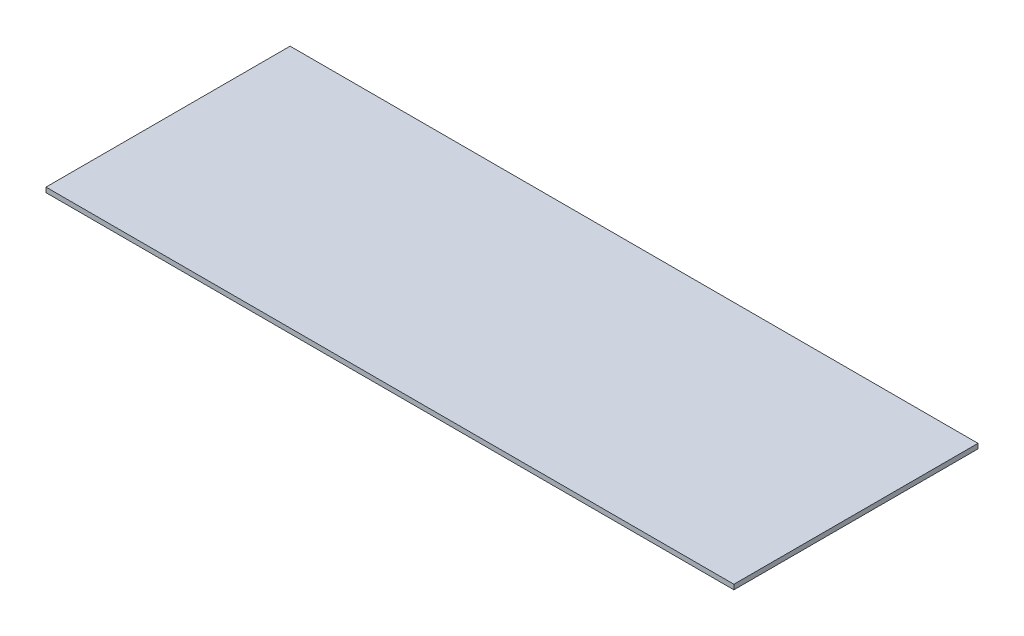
ISO-10303-21;
HEADER;
FILE_DESCRIPTION(('STEP AP214'),'2;1');
FILE_NAME('part.step','',(''),(''),'','','');
FILE_SCHEMA(('AUTOMOTIVE_DESIGN { 1 0 10303 214 1 1 1 1 }'));
ENDSEC;
DATA;
#1=APPLICATION_CONTEXT('core data for automotive mechanical design processes');
#2=APPLICATION_PROTOCOL_DEFINITION('international standard','automotive_design',2000,#1);
#3=PRODUCT_CONTEXT('',#1,'mechanical');
#4=PRODUCT('Part','Part','',(#3));
#5=PRODUCT_RELATED_PRODUCT_CATEGORY('part','',(#4));
#6=PRODUCT_DEFINITION_FORMATION('','',#4);
#7=PRODUCT_DEFINITION_CONTEXT('part definition',#1,'design');
#8=PRODUCT_DEFINITION('design','',#6,#7);
#9=PRODUCT_DEFINITION_SHAPE('','',#8);
#10=(LENGTH_UNIT() NAMED_UNIT(*) SI_UNIT(.MILLI.,.METRE.));
#11=(NAMED_UNIT(*) PLANE_ANGLE_UNIT() SI_UNIT($,.RADIAN.));
#12=(NAMED_UNIT(*) SI_UNIT($,.STERADIAN.) SOLID_ANGLE_UNIT());
#13=UNCERTAINTY_MEASURE_WITH_UNIT(LENGTH_MEASURE(1.E-05),#10,'distance_accuracy_value','');
#14=(GEOMETRIC_REPRESENTATION_CONTEXT(3) GLOBAL_UNCERTAINTY_ASSIGNED_CONTEXT((#13)) GLOBAL_UNIT_ASSIGNED_CONTEXT((#10,
#11,#12)) REPRESENTATION_CONTEXT('',''));
#15=CARTESIAN_POINT('',(0.,0.,0.));
#16=DIRECTION('',(0.,0.,1.));
#17=DIRECTION('',(1.,0.,0.));
#18=AXIS2_PLACEMENT_3D('',#15,#16,#17);
#19=CARTESIAN_POINT('',(393.7,5.55625,139.7));
#20=DIRECTION('',(-1.,0.,0.));
#21=DIRECTION('',(0.,0.,1.));
#22=AXIS2_PLACEMENT_3D('',#19,#20,#21);
#23=PLANE('',#22);
#24=DIRECTION('',(0.,0.,-1.));
#25=VECTOR('',#24,1.);
#26=CARTESIAN_POINT('',(393.7,0.,139.7));
#27=LINE('',#26,#25);
#28=CARTESIAN_POINT('',(393.7,0.,139.7));
#29=VERTEX_POINT('',#28);
#30=CARTESIAN_POINT('',(393.7,0.,-139.7));
#31=VERTEX_POINT('',#30);
#32=EDGE_CURVE('E96',#29,#31,#27,.T.);
#33=ORIENTED_EDGE('',*,*,#32,.T.);
#34=DIRECTION('',(0.,-1.,0.));
#35=VECTOR('',#34,1.);
#36=CARTESIAN_POINT('',(393.7,5.55625,-139.7));
#37=LINE('',#36,#35);
#38=CARTESIAN_POINT('',(393.7,5.55625,-139.7));
#39=VERTEX_POINT('',#38);
#40=EDGE_CURVE('E11',#39,#31,#37,.T.);
#41=ORIENTED_EDGE('',*,*,#40,.F.);
#42=DIRECTION('',(0.,0.,-1.));
#43=VECTOR('',#42,1.);
#44=CARTESIAN_POINT('',(393.7,5.55625,139.7));
#45=LINE('',#44,#43);
#46=CARTESIAN_POINT('',(393.7,5.55625,139.7));
#47=VERTEX_POINT('',#46);
#48=EDGE_CURVE('E84',#47,#39,#45,.T.);
#49=ORIENTED_EDGE('',*,*,#48,.F.);
#50=DIRECTION('',(0.,-1.,0.));
#51=VECTOR('',#50,1.);
#52=CARTESIAN_POINT('',(393.7,5.55625,139.7));
#53=LINE('',#52,#51);
#54=EDGE_CURVE('E92',#47,#29,#53,.T.);
#55=ORIENTED_EDGE('',*,*,#54,.T.);
#56=EDGE_LOOP('',(#33,#41,#49,#55));
#57=FACE_BOUND('',#56,.T.);
#58=ADVANCED_FACE('F33',(#57),#23,.F.);
#59=CARTESIAN_POINT('',(-393.7,5.55625,-139.7));
#60=DIRECTION('',(0.,0.,1.));
#61=DIRECTION('',(1.,0.,0.));
#62=AXIS2_PLACEMENT_3D('',#59,#60,#61);
#63=PLANE('',#62);
#64=DIRECTION('',(-1.,0.,0.));
#65=VECTOR('',#64,1.);
#66=CARTESIAN_POINT('',(-393.7,0.,-139.7));
#67=LINE('',#66,#65);
#68=CARTESIAN_POINT('',(-393.7,0.,-139.7));
#69=VERTEX_POINT('',#68);
#70=EDGE_CURVE('E88',#31,#69,#67,.T.);
#71=ORIENTED_EDGE('',*,*,#70,.T.);
#72=DIRECTION('',(0.,-1.,0.));
#73=VECTOR('',#72,1.);
#74=CARTESIAN_POINT('',(-393.7,5.55625,-139.7));
#75=LINE('',#74,#73);
#76=CARTESIAN_POINT('',(-393.7,5.55625,-139.7));
#77=VERTEX_POINT('',#76);
#78=EDGE_CURVE('E41',#77,#69,#75,.T.);
#79=ORIENTED_EDGE('',*,*,#78,.F.);
#80=DIRECTION('',(-1.,0.,0.));
#81=VECTOR('',#80,1.);
#82=CARTESIAN_POINT('',(-393.7,5.55625,-139.7));
#83=LINE('',#82,#81);
#84=EDGE_CURVE('E79',#39,#77,#83,.T.);
#85=ORIENTED_EDGE('',*,*,#84,.F.);
#86=ORIENTED_EDGE('',*,*,#40,.T.);
#87=EDGE_LOOP('',(#71,#79,#85,#86));
#88=FACE_BOUND('',#87,.T.);
#89=ADVANCED_FACE('F87',(#88),#63,.F.);
#90=CARTESIAN_POINT('',(-393.7,5.55625,139.7));
#91=DIRECTION('',(1.,0.,0.));
#92=DIRECTION('',(0.,0.,-1.));
#93=AXIS2_PLACEMENT_3D('',#90,#91,#92);
#94=PLANE('',#93);
#95=DIRECTION('',(0.,0.,1.));
#96=VECTOR('',#95,1.);
#97=CARTESIAN_POINT('',(-393.7,0.,139.7));
#98=LINE('',#97,#96);
#99=CARTESIAN_POINT('',(-393.7,0.,139.7));
#100=VERTEX_POINT('',#99);
#101=EDGE_CURVE('E66',#69,#100,#98,.T.);
#102=ORIENTED_EDGE('',*,*,#101,.T.);
#103=DIRECTION('',(0.,-1.,0.));
#104=VECTOR('',#103,1.);
#105=CARTESIAN_POINT('',(-393.7,5.55625,139.7));
#106=LINE('',#105,#104);
#107=CARTESIAN_POINT('',(-393.7,5.55625,139.7));
#108=VERTEX_POINT('',#107);
#109=EDGE_CURVE('E89',#108,#100,#106,.T.);
#110=ORIENTED_EDGE('',*,*,#109,.F.);
#111=DIRECTION('',(0.,0.,1.));
#112=VECTOR('',#111,1.);
#113=CARTESIAN_POINT('',(-393.7,5.55625,139.7));
#114=LINE('',#113,#112);
#115=EDGE_CURVE('E82',#77,#108,#114,.T.);
#116=ORIENTED_EDGE('',*,*,#115,.F.);
#117=ORIENTED_EDGE('',*,*,#78,.T.);
#118=EDGE_LOOP('',(#102,#110,#116,#117));
#119=FACE_BOUND('',#118,.T.);
#120=ADVANCED_FACE('F90',(#119),#94,.F.);
#121=CARTESIAN_POINT('',(-393.7,5.55625,139.7));
#122=DIRECTION('',(0.,0.,-1.));
#123=DIRECTION('',(-1.,0.,0.));
#124=AXIS2_PLACEMENT_3D('',#121,#122,#123);
#125=PLANE('',#124);
#126=DIRECTION('',(1.,0.,0.));
#127=VECTOR('',#126,1.);
#128=CARTESIAN_POINT('',(-393.7,0.,139.7));
#129=LINE('',#128,#127);
#130=EDGE_CURVE('E72',#100,#29,#129,.T.);
#131=ORIENTED_EDGE('',*,*,#130,.T.);
#132=ORIENTED_EDGE('',*,*,#54,.F.);
#133=DIRECTION('',(1.,0.,0.));
#134=VECTOR('',#133,1.);
#135=CARTESIAN_POINT('',(-393.7,5.55625,139.7));
#136=LINE('',#135,#134);
#137=EDGE_CURVE('E49',#108,#47,#136,.T.);
#138=ORIENTED_EDGE('',*,*,#137,.F.);
#139=ORIENTED_EDGE('',*,*,#109,.T.);
#140=EDGE_LOOP('',(#131,#132,#138,#139));
#141=FACE_BOUND('',#140,.T.);
#142=ADVANCED_FACE('F103',(#141),#125,.F.);
#143=CARTESIAN_POINT('',(0.,5.55625,0.));
#144=DIRECTION('',(0.,-1.,0.));
#145=DIRECTION('',(0.,0.,-1.));
#146=AXIS2_PLACEMENT_3D('',#143,#144,#145);
#147=PLANE('',#146);
#148=ORIENTED_EDGE('',*,*,#48,.T.);
#149=ORIENTED_EDGE('',*,*,#84,.T.);
#150=ORIENTED_EDGE('',*,*,#115,.T.);
#151=ORIENTED_EDGE('',*,*,#137,.T.);
#152=EDGE_LOOP('',(#148,#149,#150,#151));
#153=FACE_BOUND('',#152,.T.);
#154=ADVANCED_FACE('F80',(#153),#147,.F.);
#155=CARTESIAN_POINT('',(0.,0.,0.));
#156=DIRECTION('',(0.,-1.,0.));
#157=DIRECTION('',(0.,0.,-1.));
#158=AXIS2_PLACEMENT_3D('',#155,#156,#157);
#159=PLANE('',#158);
#160=ORIENTED_EDGE('',*,*,#32,.F.);
#161=ORIENTED_EDGE('',*,*,#130,.F.);
#162=ORIENTED_EDGE('',*,*,#101,.F.);
#163=ORIENTED_EDGE('',*,*,#70,.F.);
#164=EDGE_LOOP('',(#160,#161,#162,#163));
#165=FACE_BOUND('',#164,.T.);
#166=ADVANCED_FACE('F106',(#165),#159,.T.);
#167=CLOSED_SHELL('',(#58,#89,#120,#142,#154,#166));
#168=MANIFOLD_SOLID_BREP('B2',#167);
#169=ADVANCED_BREP_SHAPE_REPRESENTATION('',(#18,#168),#14);
#170=SHAPE_DEFINITION_REPRESENTATION(#9,#169);
ENDSEC;
END-ISO-10303-21;
